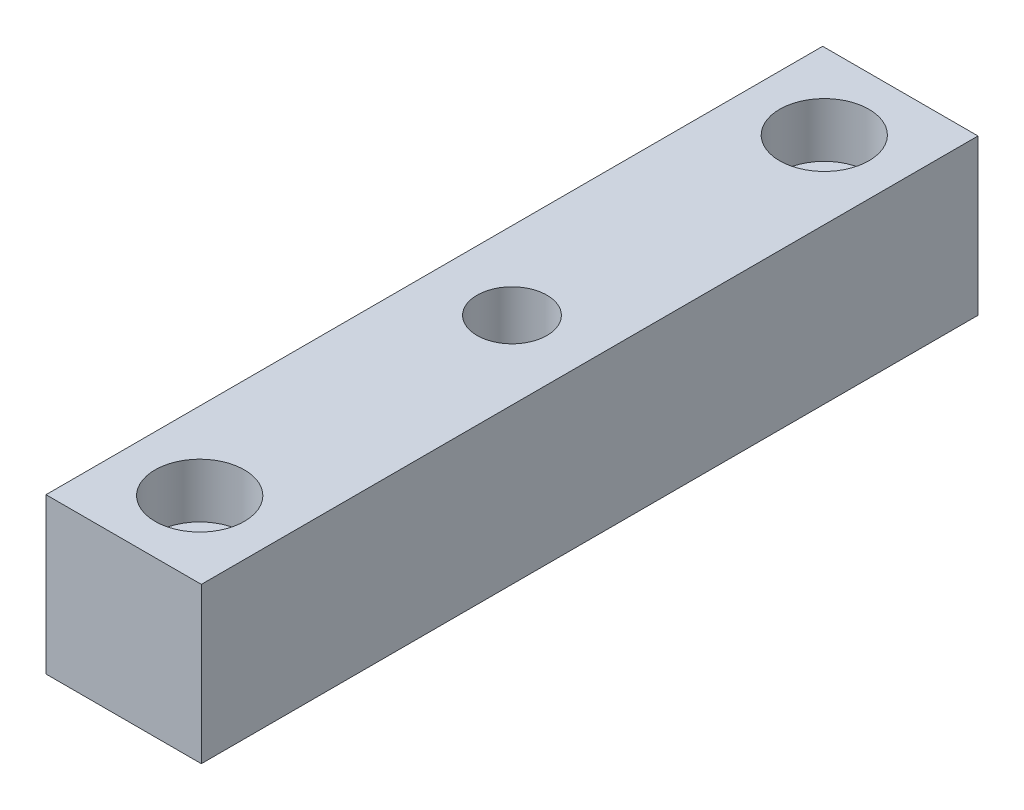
from build123d import *

# Parameters (mm, degrees)
ESQUISSE1_W                                     = 40
ESQUISSE1_H                                     = 40
EXTRUSION1_DEPTH                                = 100
TROU_TARAUD_M20X2_01_D                          = 18
TROU_TARAUD_M20X2_01_DEPTH                      = 33
TROU_TARAUD_M20X2_01_TIP                        = 5.196152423
CHAMBRAGE_POUR_VIS_T_TE_CYLINDRIQUE_D           = 16
CHAMBRAGE_POUR_VIS_T_TE_CYLINDRIQUE_CBORE_D     = 23
CHAMBRAGE_POUR_VIS_T_TE_CYLINDRIQUE_CBORE_DEPTH = 14


with BuildPart() as part:
    # Esquisse1 → Extrusion1 (new, symmetric)
    with BuildSketch(Plane.XY):
        Rectangle(ESQUISSE1_W, ESQUISSE1_H)
    extrude(amount=EXTRUSION1_DEPTH, both=True)

    # Trou taraud_ M20x2.01
    with Locations(Plane(origin=(0, 20, 0), x_dir=(-1, 0, 0), z_dir=(0, 1, 0))):
        with Locations((0, 0)):
            Hole(TROU_TARAUD_M20X2_01_D / 2, depth=TROU_TARAUD_M20X2_01_DEPTH)
            with Locations((0, 0, -(TROU_TARAUD_M20X2_01_DEPTH + TROU_TARAUD_M20X2_01_TIP / 2))):  # 120° drill point
                Cone(0, TROU_TARAUD_M20X2_01_D / 2, TROU_TARAUD_M20X2_01_TIP, mode=Mode.SUBTRACT)

    # Chambrage pour vis _ t_te cylindrique (through all)
    with Locations(Plane(origin=(0, 20, 0), x_dir=(-1, 0, 0), z_dir=(0, 1, 0))):
        with Locations((0, 80.415), (0, -80.415)):
            CounterBoreHole(CHAMBRAGE_POUR_VIS_T_TE_CYLINDRIQUE_D / 2, CHAMBRAGE_POUR_VIS_T_TE_CYLINDRIQUE_CBORE_D / 2, CHAMBRAGE_POUR_VIS_T_TE_CYLINDRIQUE_CBORE_DEPTH)


solid = part.part
